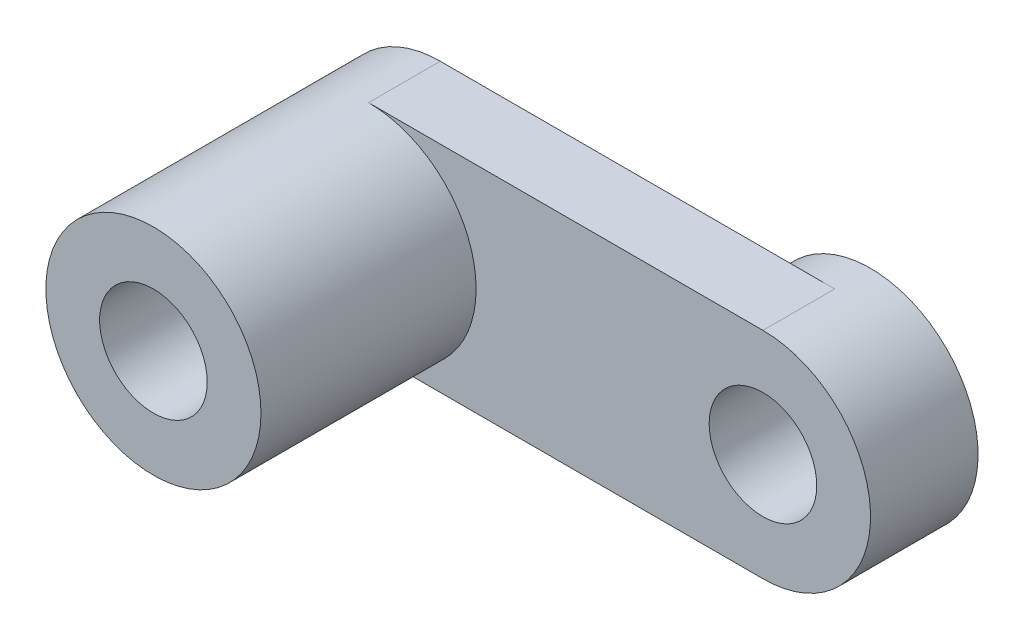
ISO-10303-21;
HEADER;
FILE_DESCRIPTION(('STEP AP214'),'2;1');
FILE_NAME('part.step','',(''),(''),'','','');
FILE_SCHEMA(('AUTOMOTIVE_DESIGN { 1 0 10303 214 1 1 1 1 }'));
ENDSEC;
DATA;
#1=APPLICATION_CONTEXT('core data for automotive mechanical design processes');
#2=APPLICATION_PROTOCOL_DEFINITION('international standard','automotive_design',2000,#1);
#3=PRODUCT_CONTEXT('',#1,'mechanical');
#4=PRODUCT('Part','Part','',(#3));
#5=PRODUCT_RELATED_PRODUCT_CATEGORY('part','',(#4));
#6=PRODUCT_DEFINITION_FORMATION('','',#4);
#7=PRODUCT_DEFINITION_CONTEXT('part definition',#1,'design');
#8=PRODUCT_DEFINITION('design','',#6,#7);
#9=PRODUCT_DEFINITION_SHAPE('','',#8);
#10=(LENGTH_UNIT() NAMED_UNIT(*) SI_UNIT(.MILLI.,.METRE.));
#11=(NAMED_UNIT(*) PLANE_ANGLE_UNIT() SI_UNIT($,.RADIAN.));
#12=(NAMED_UNIT(*) SI_UNIT($,.STERADIAN.) SOLID_ANGLE_UNIT());
#13=UNCERTAINTY_MEASURE_WITH_UNIT(LENGTH_MEASURE(1.E-05),#10,'distance_accuracy_value','');
#14=(GEOMETRIC_REPRESENTATION_CONTEXT(3) GLOBAL_UNCERTAINTY_ASSIGNED_CONTEXT((#13)) GLOBAL_UNIT_ASSIGNED_CONTEXT((#10,
#11,#12)) REPRESENTATION_CONTEXT('',''));
#15=CARTESIAN_POINT('',(0.,0.,0.));
#16=DIRECTION('',(0.,0.,1.));
#17=DIRECTION('',(1.,0.,0.));
#18=AXIS2_PLACEMENT_3D('',#15,#16,#17);
#19=CARTESIAN_POINT('',(0.,0.,-2.));
#20=DIRECTION('',(0.,0.,1.));
#21=DIRECTION('',(1.,0.,0.));
#22=AXIS2_PLACEMENT_3D('',#19,#20,#21);
#23=PLANE('',#22);
#24=CARTESIAN_POINT('',(0.,0.,-2.));
#25=DIRECTION('',(0.,0.,1.));
#26=DIRECTION('',(1.,0.,0.));
#27=AXIS2_PLACEMENT_3D('',#24,#25,#26);
#28=CIRCLE('',#27,1.5);
#29=CARTESIAN_POINT('',(1.5,0.,-2.));
#30=VERTEX_POINT('',#29);
#31=EDGE_CURVE('E103',#30,#30,#28,.T.);
#32=ORIENTED_EDGE('',*,*,#31,.T.);
#33=EDGE_LOOP('',(#32));
#34=FACE_BOUND('',#33,.T.);
#35=CARTESIAN_POINT('',(11.,0.,-2.));
#36=DIRECTION('',(0.,0.,-1.));
#37=DIRECTION('',(-1.,0.,0.));
#38=AXIS2_PLACEMENT_3D('',#35,#36,#37);
#39=CIRCLE('',#38,3.);
#40=CARTESIAN_POINT('',(11.,-3.,-2.));
#41=VERTEX_POINT('',#40);
#42=CARTESIAN_POINT('',(11.,3.,-2.));
#43=VERTEX_POINT('',#42);
#44=EDGE_CURVE('E11',#41,#43,#39,.T.);
#45=ORIENTED_EDGE('',*,*,#44,.F.);
#46=DIRECTION('',(1.,0.,0.));
#47=VECTOR('',#46,1.);
#48=CARTESIAN_POINT('',(0.,-3.,-2.));
#49=LINE('',#48,#47);
#50=CARTESIAN_POINT('',(0.,-3.,-2.));
#51=VERTEX_POINT('',#50);
#52=EDGE_CURVE('E73',#51,#41,#49,.T.);
#53=ORIENTED_EDGE('',*,*,#52,.F.);
#54=CARTESIAN_POINT('',(0.,0.,-2.));
#55=DIRECTION('',(0.,0.,1.));
#56=DIRECTION('',(1.,0.,0.));
#57=AXIS2_PLACEMENT_3D('',#54,#55,#56);
#58=CIRCLE('',#57,3.);
#59=CARTESIAN_POINT('',(0.,3.,-2.));
#60=VERTEX_POINT('',#59);
#61=EDGE_CURVE('E70',#60,#51,#58,.T.);
#62=ORIENTED_EDGE('',*,*,#61,.F.);
#63=DIRECTION('',(-1.,0.,0.));
#64=VECTOR('',#63,1.);
#65=CARTESIAN_POINT('',(0.,3.,-2.));
#66=LINE('',#65,#64);
#67=EDGE_CURVE('E68',#43,#60,#66,.T.);
#68=ORIENTED_EDGE('',*,*,#67,.F.);
#69=EDGE_LOOP('',(#45,#53,#62,#68));
#70=FACE_BOUND('',#69,.T.);
#71=ADVANCED_FACE('F26',(#34,#70),#23,.F.);
#72=CARTESIAN_POINT('',(0.,0.,-2.));
#73=DIRECTION('',(0.,0.,1.));
#74=DIRECTION('',(1.,0.,0.));
#75=AXIS2_PLACEMENT_3D('',#72,#73,#74);
#76=CYLINDRICAL_SURFACE('',#75,3.);
#77=DIRECTION('',(0.,0.,1.));
#78=VECTOR('',#77,1.);
#79=CARTESIAN_POINT('',(0.,-3.,-2.));
#80=LINE('',#79,#78);
#81=CARTESIAN_POINT('',(0.,-3.,0.));
#82=VERTEX_POINT('',#81);
#83=EDGE_CURVE('E72',#51,#82,#80,.T.);
#84=ORIENTED_EDGE('',*,*,#83,.T.);
#85=CARTESIAN_POINT('',(0.,0.,0.));
#86=DIRECTION('',(0.,0.,1.));
#87=DIRECTION('',(1.,0.,0.));
#88=AXIS2_PLACEMENT_3D('',#85,#86,#87);
#89=CIRCLE('',#88,3.);
#90=CARTESIAN_POINT('',(0.,3.,0.));
#91=VERTEX_POINT('',#90);
#92=EDGE_CURVE('E35',#82,#91,#89,.T.);
#93=ORIENTED_EDGE('',*,*,#92,.T.);
#94=DIRECTION('',(0.,0.,1.));
#95=VECTOR('',#94,1.);
#96=CARTESIAN_POINT('',(0.,3.,-2.));
#97=LINE('',#96,#95);
#98=EDGE_CURVE('E43',#60,#91,#97,.T.);
#99=ORIENTED_EDGE('',*,*,#98,.F.);
#100=ORIENTED_EDGE('',*,*,#61,.T.);
#101=EDGE_LOOP('',(#84,#93,#99,#100));
#102=FACE_BOUND('',#101,.T.);
#103=CARTESIAN_POINT('',(0.,0.,6.));
#104=DIRECTION('',(0.,0.,1.));
#105=DIRECTION('',(1.,0.,0.));
#106=AXIS2_PLACEMENT_3D('',#103,#104,#105);
#107=CIRCLE('',#106,3.);
#108=CARTESIAN_POINT('',(3.,0.,6.));
#109=VERTEX_POINT('',#108);
#110=EDGE_CURVE('E117',#109,#109,#107,.T.);
#111=ORIENTED_EDGE('',*,*,#110,.F.);
#112=EDGE_LOOP('',(#111));
#113=FACE_BOUND('',#112,.T.);
#114=ADVANCED_FACE('F28',(#102,#113),#76,.T.);
#115=CARTESIAN_POINT('',(0.,3.,-2.));
#116=DIRECTION('',(0.,1.,0.));
#117=DIRECTION('',(0.,0.,1.));
#118=AXIS2_PLACEMENT_3D('',#115,#116,#117);
#119=PLANE('',#118);
#120=DIRECTION('',(-1.,0.,0.));
#121=VECTOR('',#120,1.);
#122=CARTESIAN_POINT('',(0.,3.,0.));
#123=LINE('',#122,#121);
#124=CARTESIAN_POINT('',(11.,3.,0.));
#125=VERTEX_POINT('',#124);
#126=EDGE_CURVE('E78',#125,#91,#123,.T.);
#127=ORIENTED_EDGE('',*,*,#126,.F.);
#128=DIRECTION('',(0.,0.,1.));
#129=VECTOR('',#128,1.);
#130=CARTESIAN_POINT('',(11.,3.,-2.));
#131=LINE('',#130,#129);
#132=EDGE_CURVE('E76',#43,#125,#131,.T.);
#133=ORIENTED_EDGE('',*,*,#132,.F.);
#134=ORIENTED_EDGE('',*,*,#67,.T.);
#135=ORIENTED_EDGE('',*,*,#98,.T.);
#136=EDGE_LOOP('',(#127,#133,#134,#135));
#137=FACE_BOUND('',#136,.T.);
#138=ADVANCED_FACE('F77',(#137),#119,.T.);
#139=CARTESIAN_POINT('',(11.,0.,-2.));
#140=DIRECTION('',(0.,0.,1.));
#141=DIRECTION('',(1.,0.,0.));
#142=AXIS2_PLACEMENT_3D('',#139,#140,#141);
#143=CYLINDRICAL_SURFACE('',#142,3.);
#144=CARTESIAN_POINT('',(11.,0.,0.));
#145=DIRECTION('',(0.,0.,1.));
#146=DIRECTION('',(1.,0.,0.));
#147=AXIS2_PLACEMENT_3D('',#144,#145,#146);
#148=CIRCLE('',#147,3.);
#149=CARTESIAN_POINT('',(11.,-3.,0.));
#150=VERTEX_POINT('',#149);
#151=EDGE_CURVE('E87',#150,#125,#148,.T.);
#152=ORIENTED_EDGE('',*,*,#151,.F.);
#153=DIRECTION('',(0.,0.,1.));
#154=VECTOR('',#153,1.);
#155=CARTESIAN_POINT('',(11.,-3.,-2.));
#156=LINE('',#155,#154);
#157=EDGE_CURVE('E82',#41,#150,#156,.T.);
#158=ORIENTED_EDGE('',*,*,#157,.F.);
#159=ORIENTED_EDGE('',*,*,#44,.T.);
#160=ORIENTED_EDGE('',*,*,#132,.T.);
#161=EDGE_LOOP('',(#152,#158,#159,#160));
#162=FACE_BOUND('',#161,.T.);
#163=CARTESIAN_POINT('',(11.,0.,-3.));
#164=DIRECTION('',(0.,0.,-1.));
#165=DIRECTION('',(-1.,0.,0.));
#166=AXIS2_PLACEMENT_3D('',#163,#164,#165);
#167=CIRCLE('',#166,3.);
#168=CARTESIAN_POINT('',(8.,0.,-3.));
#169=VERTEX_POINT('',#168);
#170=EDGE_CURVE('E107',#169,#169,#167,.T.);
#171=ORIENTED_EDGE('',*,*,#170,.F.);
#172=EDGE_LOOP('',(#171));
#173=FACE_BOUND('',#172,.T.);
#174=ADVANCED_FACE('F84',(#162,#173),#143,.T.);
#175=CARTESIAN_POINT('',(0.,-3.,-2.));
#176=DIRECTION('',(0.,-1.,0.));
#177=DIRECTION('',(0.,0.,-1.));
#178=AXIS2_PLACEMENT_3D('',#175,#176,#177);
#179=PLANE('',#178);
#180=DIRECTION('',(1.,0.,0.));
#181=VECTOR('',#180,1.);
#182=CARTESIAN_POINT('',(0.,-3.,0.));
#183=LINE('',#182,#181);
#184=EDGE_CURVE('E120',#82,#150,#183,.T.);
#185=ORIENTED_EDGE('',*,*,#184,.F.);
#186=ORIENTED_EDGE('',*,*,#83,.F.);
#187=ORIENTED_EDGE('',*,*,#52,.T.);
#188=ORIENTED_EDGE('',*,*,#157,.T.);
#189=EDGE_LOOP('',(#185,#186,#187,#188));
#190=FACE_BOUND('',#189,.T.);
#191=ADVANCED_FACE('F92',(#190),#179,.T.);
#192=CARTESIAN_POINT('',(0.,0.,0.));
#193=DIRECTION('',(0.,0.,1.));
#194=DIRECTION('',(1.,0.,0.));
#195=AXIS2_PLACEMENT_3D('',#192,#193,#194);
#196=PLANE('',#195);
#197=CARTESIAN_POINT('',(11.,0.,0.));
#198=DIRECTION('',(0.,0.,1.));
#199=DIRECTION('',(1.,0.,0.));
#200=AXIS2_PLACEMENT_3D('',#197,#198,#199);
#201=CIRCLE('',#200,1.5);
#202=CARTESIAN_POINT('',(12.5,0.,0.));
#203=VERTEX_POINT('',#202);
#204=EDGE_CURVE('E102',#203,#203,#201,.T.);
#205=ORIENTED_EDGE('',*,*,#204,.F.);
#206=EDGE_LOOP('',(#205));
#207=FACE_BOUND('',#206,.T.);
#208=ORIENTED_EDGE('',*,*,#92,.F.);
#209=ORIENTED_EDGE('',*,*,#184,.T.);
#210=ORIENTED_EDGE('',*,*,#151,.T.);
#211=ORIENTED_EDGE('',*,*,#126,.T.);
#212=EDGE_LOOP('',(#208,#209,#210,#211));
#213=FACE_BOUND('',#212,.T.);
#214=ADVANCED_FACE('F142',(#207,#213),#196,.T.);
#215=CARTESIAN_POINT('',(0.,0.,6.));
#216=DIRECTION('',(0.,0.,1.));
#217=DIRECTION('',(1.,0.,0.));
#218=AXIS2_PLACEMENT_3D('',#215,#216,#217);
#219=PLANE('',#218);
#220=CARTESIAN_POINT('',(0.,0.,6.));
#221=DIRECTION('',(0.,0.,1.));
#222=DIRECTION('',(1.,0.,0.));
#223=AXIS2_PLACEMENT_3D('',#220,#221,#222);
#224=CIRCLE('',#223,1.5);
#225=CARTESIAN_POINT('',(1.5,0.,6.));
#226=VERTEX_POINT('',#225);
#227=EDGE_CURVE('E30',#226,#226,#224,.T.);
#228=ORIENTED_EDGE('',*,*,#227,.F.);
#229=EDGE_LOOP('',(#228));
#230=FACE_BOUND('',#229,.T.);
#231=ORIENTED_EDGE('',*,*,#110,.T.);
#232=EDGE_LOOP('',(#231));
#233=FACE_BOUND('',#232,.T.);
#234=ADVANCED_FACE('F147',(#230,#233),#219,.T.);
#235=CARTESIAN_POINT('',(11.,0.,-3.));
#236=DIRECTION('',(0.,0.,-1.));
#237=DIRECTION('',(-1.,0.,0.));
#238=AXIS2_PLACEMENT_3D('',#235,#236,#237);
#239=PLANE('',#238);
#240=CARTESIAN_POINT('',(11.,0.,-3.));
#241=DIRECTION('',(0.,0.,-1.));
#242=DIRECTION('',(-1.,0.,0.));
#243=AXIS2_PLACEMENT_3D('',#240,#241,#242);
#244=CIRCLE('',#243,1.5);
#245=CARTESIAN_POINT('',(9.5,0.,-3.));
#246=VERTEX_POINT('',#245);
#247=EDGE_CURVE('E100',#246,#246,#244,.T.);
#248=ORIENTED_EDGE('',*,*,#247,.F.);
#249=EDGE_LOOP('',(#248));
#250=FACE_BOUND('',#249,.T.);
#251=ORIENTED_EDGE('',*,*,#170,.T.);
#252=EDGE_LOOP('',(#251));
#253=FACE_BOUND('',#252,.T.);
#254=ADVANCED_FACE('F149',(#250,#253),#239,.T.);
#255=CARTESIAN_POINT('',(11.,0.,8.));
#256=DIRECTION('',(0.,0.,-1.));
#257=DIRECTION('',(-1.,0.,0.));
#258=AXIS2_PLACEMENT_3D('',#255,#256,#257);
#259=CYLINDRICAL_SURFACE('',#258,1.5);
#260=ORIENTED_EDGE('',*,*,#204,.T.);
#261=EDGE_LOOP('',(#260));
#262=FACE_BOUND('',#261,.T.);
#263=ORIENTED_EDGE('',*,*,#247,.T.);
#264=EDGE_LOOP('',(#263));
#265=FACE_BOUND('',#264,.T.);
#266=ADVANCED_FACE('F156',(#262,#265),#259,.F.);
#267=CARTESIAN_POINT('',(0.,0.,8.));
#268=DIRECTION('',(0.,0.,-1.));
#269=DIRECTION('',(-1.,0.,0.));
#270=AXIS2_PLACEMENT_3D('',#267,#268,#269);
#271=CYLINDRICAL_SURFACE('',#270,1.5);
#272=ORIENTED_EDGE('',*,*,#227,.T.);
#273=EDGE_LOOP('',(#272));
#274=FACE_BOUND('',#273,.T.);
#275=ORIENTED_EDGE('',*,*,#31,.F.);
#276=EDGE_LOOP('',(#275));
#277=FACE_BOUND('',#276,.T.);
#278=ADVANCED_FACE('F210',(#274,#277),#271,.F.);
#279=CLOSED_SHELL('',(#71,#114,#138,#174,#191,#214,#234,#254,#266,#278));
#280=MANIFOLD_SOLID_BREP('B2',#279);
#281=ADVANCED_BREP_SHAPE_REPRESENTATION('',(#18,#280),#14);
#282=SHAPE_DEFINITION_REPRESENTATION(#9,#281);
ENDSEC;
END-ISO-10303-21;
